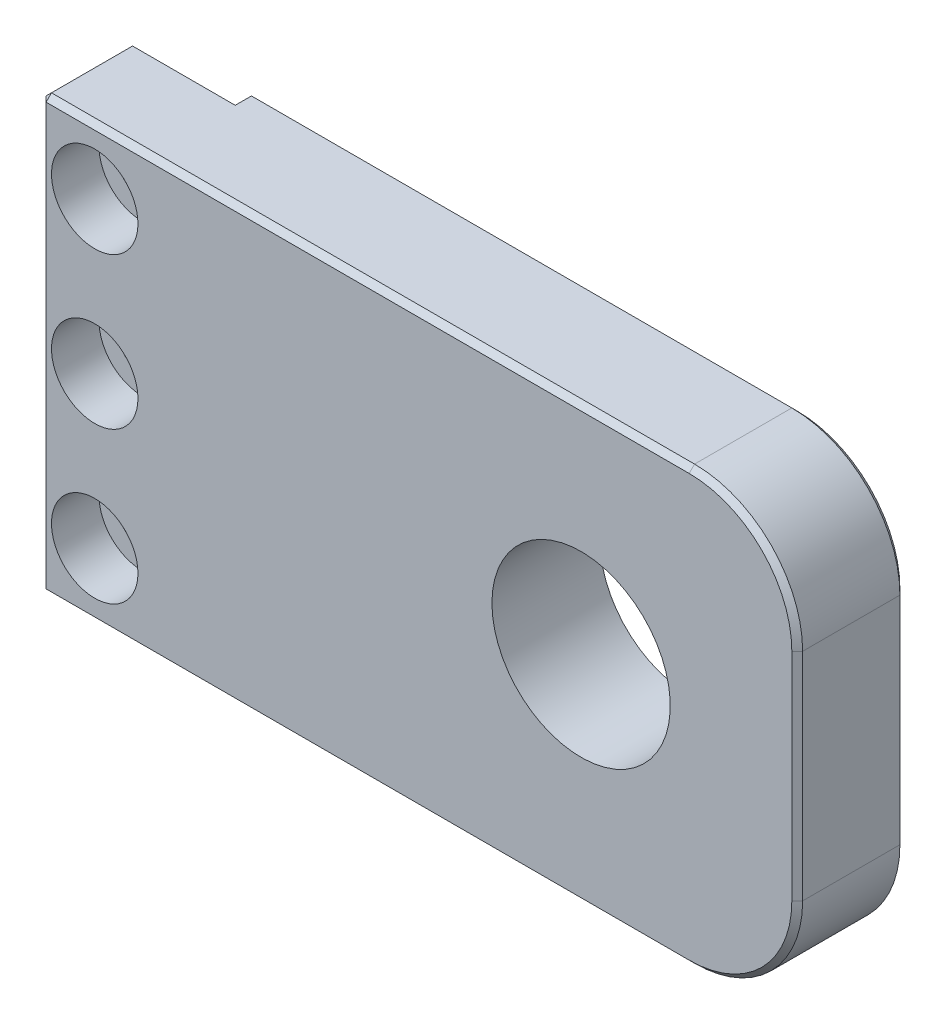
ISO-10303-21;
HEADER;
FILE_DESCRIPTION(('STEP AP214'),'2;1');
FILE_NAME('part.step','',(''),(''),'','','');
FILE_SCHEMA(('AUTOMOTIVE_DESIGN { 1 0 10303 214 1 1 1 1 }'));
ENDSEC;
DATA;
#1=APPLICATION_CONTEXT('core data for automotive mechanical design processes');
#2=APPLICATION_PROTOCOL_DEFINITION('international standard','automotive_design',2000,#1);
#3=PRODUCT_CONTEXT('',#1,'mechanical');
#4=PRODUCT('Part','Part','',(#3));
#5=PRODUCT_RELATED_PRODUCT_CATEGORY('part','',(#4));
#6=PRODUCT_DEFINITION_FORMATION('','',#4);
#7=PRODUCT_DEFINITION_CONTEXT('part definition',#1,'design');
#8=PRODUCT_DEFINITION('design','',#6,#7);
#9=PRODUCT_DEFINITION_SHAPE('','',#8);
#10=(LENGTH_UNIT() NAMED_UNIT(*) SI_UNIT(.MILLI.,.METRE.));
#11=(NAMED_UNIT(*) PLANE_ANGLE_UNIT() SI_UNIT($,.RADIAN.));
#12=(NAMED_UNIT(*) SI_UNIT($,.STERADIAN.) SOLID_ANGLE_UNIT());
#13=UNCERTAINTY_MEASURE_WITH_UNIT(LENGTH_MEASURE(1.E-05),#10,'distance_accuracy_value','');
#14=(GEOMETRIC_REPRESENTATION_CONTEXT(3) GLOBAL_UNCERTAINTY_ASSIGNED_CONTEXT((#13)) GLOBAL_UNIT_ASSIGNED_CONTEXT((#10,
#11,#12)) REPRESENTATION_CONTEXT('',''));
#15=CARTESIAN_POINT('',(0.,0.,0.));
#16=DIRECTION('',(0.,0.,1.));
#17=DIRECTION('',(1.,0.,0.));
#18=AXIS2_PLACEMENT_3D('',#15,#16,#17);
#19=CARTESIAN_POINT('',(35.,20.,10.));
#20=DIRECTION('',(-1.,0.,0.));
#21=DIRECTION('',(0.,0.,1.));
#22=AXIS2_PLACEMENT_3D('',#19,#20,#21);
#23=PLANE('',#22);
#24=DIRECTION('',(0.,0.,-1.));
#25=VECTOR('',#24,1.);
#26=CARTESIAN_POINT('',(35.,-10.,10.));
#27=LINE('',#26,#25);
#28=CARTESIAN_POINT('',(35.,-10.,9.5));
#29=VERTEX_POINT('',#28);
#30=CARTESIAN_POINT('',(35.,-10.,0.500000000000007));
#31=VERTEX_POINT('',#30);
#32=EDGE_CURVE('E176',#29,#31,#27,.T.);
#33=ORIENTED_EDGE('',*,*,#32,.T.);
#34=DIRECTION('',(0.,1.,0.));
#35=VECTOR('',#34,1.);
#36=CARTESIAN_POINT('',(35.,20.,0.500000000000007));
#37=LINE('',#36,#35);
#38=CARTESIAN_POINT('',(35.,10.,0.500000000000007));
#39=VERTEX_POINT('',#38);
#40=EDGE_CURVE('E249',#31,#39,#37,.T.);
#41=ORIENTED_EDGE('',*,*,#40,.T.);
#42=DIRECTION('',(0.,0.,-1.));
#43=VECTOR('',#42,1.);
#44=CARTESIAN_POINT('',(35.,10.,10.));
#45=LINE('',#44,#43);
#46=CARTESIAN_POINT('',(35.,10.,9.5));
#47=VERTEX_POINT('',#46);
#48=EDGE_CURVE('E178',#39,#47,#45,.F.);
#49=ORIENTED_EDGE('',*,*,#48,.T.);
#50=DIRECTION('',(0.,-1.,0.));
#51=VECTOR('',#50,1.);
#52=CARTESIAN_POINT('',(35.,-10.,9.5));
#53=LINE('',#52,#51);
#54=EDGE_CURVE('E38',#47,#29,#53,.T.);
#55=ORIENTED_EDGE('',*,*,#54,.T.);
#56=EDGE_LOOP('',(#33,#41,#49,#55));
#57=FACE_BOUND('',#56,.T.);
#58=ADVANCED_FACE('F16',(#57),#23,.F.);
#59=CARTESIAN_POINT('',(-35.,20.,10.));
#60=DIRECTION('',(0.,-1.,0.));
#61=DIRECTION('',(0.,0.,-1.));
#62=AXIS2_PLACEMENT_3D('',#59,#60,#61);
#63=PLANE('',#62);
#64=DIRECTION('',(0.,0.,-1.));
#65=VECTOR('',#64,1.);
#66=CARTESIAN_POINT('',(25.,20.,10.));
#67=LINE('',#66,#65);
#68=CARTESIAN_POINT('',(25.,20.,9.5));
#69=VERTEX_POINT('',#68);
#70=CARTESIAN_POINT('',(25.,20.,0.500000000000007));
#71=VERTEX_POINT('',#70);
#72=EDGE_CURVE('E171',#69,#71,#67,.T.);
#73=ORIENTED_EDGE('',*,*,#72,.T.);
#74=DIRECTION('',(-1.,0.,0.));
#75=VECTOR('',#74,1.);
#76=CARTESIAN_POINT('',(-35.,20.,0.500000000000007));
#77=LINE('',#76,#75);
#78=CARTESIAN_POINT('',(-25.,20.,0.500000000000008));
#79=VERTEX_POINT('',#78);
#80=EDGE_CURVE('E228',#71,#79,#77,.T.);
#81=ORIENTED_EDGE('',*,*,#80,.T.);
#82=DIRECTION('',(0.,0.,-1.));
#83=VECTOR('',#82,1.);
#84=CARTESIAN_POINT('',(-25.,20.,2.));
#85=LINE('',#84,#83);
#86=CARTESIAN_POINT('',(-25.,20.,2.));
#87=VERTEX_POINT('',#86);
#88=EDGE_CURVE('E158',#87,#79,#85,.T.);
#89=ORIENTED_EDGE('',*,*,#88,.F.);
#90=DIRECTION('',(1.,0.,0.));
#91=VECTOR('',#90,1.);
#92=CARTESIAN_POINT('',(-25.,20.,2.));
#93=LINE('',#92,#91);
#94=CARTESIAN_POINT('',(-34.5,20.,2.));
#95=VERTEX_POINT('',#94);
#96=EDGE_CURVE('E147',#95,#87,#93,.T.);
#97=ORIENTED_EDGE('',*,*,#96,.F.);
#98=DIRECTION('',(0.,0.,1.));
#99=VECTOR('',#98,1.);
#100=CARTESIAN_POINT('',(-34.5,20.,10.));
#101=LINE('',#100,#99);
#102=CARTESIAN_POINT('',(-34.5,20.,9.5));
#103=VERTEX_POINT('',#102);
#104=EDGE_CURVE('E226',#95,#103,#101,.T.);
#105=ORIENTED_EDGE('',*,*,#104,.T.);
#106=DIRECTION('',(1.,0.,0.));
#107=VECTOR('',#106,1.);
#108=CARTESIAN_POINT('',(25.,20.,9.5));
#109=LINE('',#108,#107);
#110=EDGE_CURVE('E224',#103,#69,#109,.T.);
#111=ORIENTED_EDGE('',*,*,#110,.T.);
#112=EDGE_LOOP('',(#73,#81,#89,#97,#105,#111));
#113=FACE_BOUND('',#112,.T.);
#114=ADVANCED_FACE('F311',(#113),#63,.F.);
#115=CARTESIAN_POINT('',(-35.,20.,10.));
#116=DIRECTION('',(1.,0.,0.));
#117=DIRECTION('',(0.,1.,0.));
#118=AXIS2_PLACEMENT_3D('',#115,#116,#117);
#119=PLANE('',#118);
#120=DIRECTION('',(0.,0.,1.));
#121=VECTOR('',#120,1.);
#122=CARTESIAN_POINT('',(-35.,-19.5,10.));
#123=LINE('',#122,#121);
#124=CARTESIAN_POINT('',(-35.,-19.5,2.5));
#125=VERTEX_POINT('',#124);
#126=CARTESIAN_POINT('',(-35.,-19.5,9.5));
#127=VERTEX_POINT('',#126);
#128=EDGE_CURVE('E212',#125,#127,#123,.T.);
#129=ORIENTED_EDGE('',*,*,#128,.T.);
#130=DIRECTION('',(0.,1.,0.));
#131=VECTOR('',#130,1.);
#132=CARTESIAN_POINT('',(-35.,20.,9.5));
#133=LINE('',#132,#131);
#134=CARTESIAN_POINT('',(-35.,19.5,9.5));
#135=VERTEX_POINT('',#134);
#136=EDGE_CURVE('E214',#127,#135,#133,.T.);
#137=ORIENTED_EDGE('',*,*,#136,.T.);
#138=DIRECTION('',(0.,0.,-1.));
#139=VECTOR('',#138,1.);
#140=CARTESIAN_POINT('',(-35.,19.5,10.));
#141=LINE('',#140,#139);
#142=CARTESIAN_POINT('',(-35.,19.5,2.5));
#143=VERTEX_POINT('',#142);
#144=EDGE_CURVE('E208',#135,#143,#141,.T.);
#145=ORIENTED_EDGE('',*,*,#144,.T.);
#146=DIRECTION('',(0.,-1.,0.));
#147=VECTOR('',#146,1.);
#148=CARTESIAN_POINT('',(-35.,20.,2.5));
#149=LINE('',#148,#147);
#150=EDGE_CURVE('E210',#143,#125,#149,.T.);
#151=ORIENTED_EDGE('',*,*,#150,.T.);
#152=EDGE_LOOP('',(#129,#137,#145,#151));
#153=FACE_BOUND('',#152,.T.);
#154=ADVANCED_FACE('F368',(#153),#119,.F.);
#155=CARTESIAN_POINT('',(-35.,-20.,10.));
#156=DIRECTION('',(0.,1.,0.));
#157=DIRECTION('',(0.,0.,1.));
#158=AXIS2_PLACEMENT_3D('',#155,#156,#157);
#159=PLANE('',#158);
#160=DIRECTION('',(0.,0.,-1.));
#161=VECTOR('',#160,1.);
#162=CARTESIAN_POINT('',(-25.,-20.,2.));
#163=LINE('',#162,#161);
#164=CARTESIAN_POINT('',(-25.,-20.,2.));
#165=VERTEX_POINT('',#164);
#166=CARTESIAN_POINT('',(-25.,-20.,0.500000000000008));
#167=VERTEX_POINT('',#166);
#168=EDGE_CURVE('E136',#165,#167,#163,.T.);
#169=ORIENTED_EDGE('',*,*,#168,.T.);
#170=DIRECTION('',(1.,0.,0.));
#171=VECTOR('',#170,1.);
#172=CARTESIAN_POINT('',(-35.,-20.,0.500000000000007));
#173=LINE('',#172,#171);
#174=CARTESIAN_POINT('',(25.,-20.,0.500000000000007));
#175=VERTEX_POINT('',#174);
#176=EDGE_CURVE('E220',#167,#175,#173,.T.);
#177=ORIENTED_EDGE('',*,*,#176,.T.);
#178=DIRECTION('',(0.,0.,-1.));
#179=VECTOR('',#178,1.);
#180=CARTESIAN_POINT('',(25.,-20.,10.));
#181=LINE('',#180,#179);
#182=CARTESIAN_POINT('',(25.,-20.,9.5));
#183=VERTEX_POINT('',#182);
#184=EDGE_CURVE('E180',#175,#183,#181,.F.);
#185=ORIENTED_EDGE('',*,*,#184,.T.);
#186=DIRECTION('',(-1.,0.,0.));
#187=VECTOR('',#186,1.);
#188=CARTESIAN_POINT('',(-35.,-20.,9.5));
#189=LINE('',#188,#187);
#190=CARTESIAN_POINT('',(-34.5,-20.,9.5));
#191=VERTEX_POINT('',#190);
#192=EDGE_CURVE('E217',#183,#191,#189,.T.);
#193=ORIENTED_EDGE('',*,*,#192,.T.);
#194=DIRECTION('',(0.,0.,-1.));
#195=VECTOR('',#194,1.);
#196=CARTESIAN_POINT('',(-34.5,-20.,10.));
#197=LINE('',#196,#195);
#198=CARTESIAN_POINT('',(-34.5,-20.,2.));
#199=VERTEX_POINT('',#198);
#200=EDGE_CURVE('E139',#191,#199,#197,.T.);
#201=ORIENTED_EDGE('',*,*,#200,.T.);
#202=DIRECTION('',(1.,0.,0.));
#203=VECTOR('',#202,1.);
#204=CARTESIAN_POINT('',(-25.,-20.,2.));
#205=LINE('',#204,#203);
#206=EDGE_CURVE('E132',#199,#165,#205,.T.);
#207=ORIENTED_EDGE('',*,*,#206,.T.);
#208=EDGE_LOOP('',(#169,#177,#185,#193,#201,#207));
#209=FACE_BOUND('',#208,.T.);
#210=ADVANCED_FACE('F134',(#209),#159,.F.);
#211=CARTESIAN_POINT('',(0.,0.,10.));
#212=DIRECTION('',(0.,0.,1.));
#213=DIRECTION('',(1.,0.,0.));
#214=AXIS2_PLACEMENT_3D('',#211,#212,#213);
#215=PLANE('',#214);
#216=DIRECTION('',(-1.,0.,0.));
#217=VECTOR('',#216,1.);
#218=CARTESIAN_POINT('',(-35.,19.5,10.));
#219=LINE('',#218,#217);
#220=CARTESIAN_POINT('',(25.,19.5,10.));
#221=VERTEX_POINT('',#220);
#222=CARTESIAN_POINT('',(-34.5,19.5,10.));
#223=VERTEX_POINT('',#222);
#224=EDGE_CURVE('E203',#221,#223,#219,.T.);
#225=ORIENTED_EDGE('',*,*,#224,.T.);
#226=DIRECTION('',(0.,-1.,0.));
#227=VECTOR('',#226,1.);
#228=CARTESIAN_POINT('',(-34.5,-20.,10.));
#229=LINE('',#228,#227);
#230=CARTESIAN_POINT('',(-34.5,-19.5,10.));
#231=VERTEX_POINT('',#230);
#232=EDGE_CURVE('E205',#223,#231,#229,.T.);
#233=ORIENTED_EDGE('',*,*,#232,.T.);
#234=DIRECTION('',(1.,0.,0.));
#235=VECTOR('',#234,1.);
#236=CARTESIAN_POINT('',(25.,-19.5,10.));
#237=LINE('',#236,#235);
#238=CARTESIAN_POINT('',(25.,-19.5,10.));
#239=VERTEX_POINT('',#238);
#240=EDGE_CURVE('E199',#231,#239,#237,.T.);
#241=ORIENTED_EDGE('',*,*,#240,.T.);
#242=CARTESIAN_POINT('',(25.,-10.,10.));
#243=DIRECTION('',(0.,0.,1.));
#244=DIRECTION('',(1.,0.,0.));
#245=AXIS2_PLACEMENT_3D('',#242,#243,#244);
#246=CIRCLE('',#245,9.5);
#247=CARTESIAN_POINT('',(34.5,-10.,10.));
#248=VERTEX_POINT('',#247);
#249=EDGE_CURVE('E183',#239,#248,#246,.T.);
#250=ORIENTED_EDGE('',*,*,#249,.T.);
#251=DIRECTION('',(0.,1.,0.));
#252=VECTOR('',#251,1.);
#253=CARTESIAN_POINT('',(34.5,10.,10.));
#254=LINE('',#253,#252);
#255=CARTESIAN_POINT('',(34.5,10.,10.));
#256=VERTEX_POINT('',#255);
#257=EDGE_CURVE('E197',#248,#256,#254,.T.);
#258=ORIENTED_EDGE('',*,*,#257,.T.);
#259=CARTESIAN_POINT('',(25.,10.,10.));
#260=DIRECTION('',(0.,0.,1.));
#261=DIRECTION('',(1.,0.,0.));
#262=AXIS2_PLACEMENT_3D('',#259,#260,#261);
#263=CIRCLE('',#262,9.5);
#264=EDGE_CURVE('E201',#256,#221,#263,.T.);
#265=ORIENTED_EDGE('',*,*,#264,.T.);
#266=EDGE_LOOP('',(#225,#233,#241,#250,#258,#265));
#267=FACE_BOUND('',#266,.T.);
#268=CARTESIAN_POINT('',(-30.,14.,10.));
#269=DIRECTION('',(0.,0.,1.));
#270=DIRECTION('',(1.,0.,0.));
#271=AXIS2_PLACEMENT_3D('',#268,#269,#270);
#272=CIRCLE('',#271,4.);
#273=CARTESIAN_POINT('',(-26.,14.,10.));
#274=VERTEX_POINT('',#273);
#275=EDGE_CURVE('E285',#274,#274,#272,.T.);
#276=ORIENTED_EDGE('',*,*,#275,.F.);
#277=EDGE_LOOP('',(#276));
#278=FACE_BOUND('',#277,.T.);
#279=CARTESIAN_POINT('',(-30.,0.,10.));
#280=DIRECTION('',(0.,0.,1.));
#281=DIRECTION('',(1.,0.,0.));
#282=AXIS2_PLACEMENT_3D('',#279,#280,#281);
#283=CIRCLE('',#282,4.);
#284=CARTESIAN_POINT('',(-26.,0.,10.));
#285=VERTEX_POINT('',#284);
#286=EDGE_CURVE('E194',#285,#285,#283,.T.);
#287=ORIENTED_EDGE('',*,*,#286,.F.);
#288=EDGE_LOOP('',(#287));
#289=FACE_BOUND('',#288,.T.);
#290=CARTESIAN_POINT('',(-30.,-14.,10.));
#291=DIRECTION('',(0.,0.,1.));
#292=DIRECTION('',(1.,0.,0.));
#293=AXIS2_PLACEMENT_3D('',#290,#291,#292);
#294=CIRCLE('',#293,4.);
#295=CARTESIAN_POINT('',(-26.,-14.,10.));
#296=VERTEX_POINT('',#295);
#297=EDGE_CURVE('E189',#296,#296,#294,.T.);
#298=ORIENTED_EDGE('',*,*,#297,.F.);
#299=EDGE_LOOP('',(#298));
#300=FACE_BOUND('',#299,.T.);
#301=CARTESIAN_POINT('',(14.9999999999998,0.,10.));
#302=DIRECTION('',(0.,0.,-1.));
#303=DIRECTION('',(-1.,0.,0.));
#304=AXIS2_PLACEMENT_3D('',#301,#302,#303);
#305=CIRCLE('',#304,8.25);
#306=CARTESIAN_POINT('',(6.74999999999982,0.,10.));
#307=VERTEX_POINT('',#306);
#308=EDGE_CURVE('E168',#307,#307,#305,.T.);
#309=ORIENTED_EDGE('',*,*,#308,.T.);
#310=EDGE_LOOP('',(#309));
#311=FACE_BOUND('',#310,.T.);
#312=ADVANCED_FACE('F337',(#267,#278,#289,#300,#311),#215,.T.);
#313=CARTESIAN_POINT('',(0.,0.,0.));
#314=DIRECTION('',(0.,0.,1.));
#315=DIRECTION('',(1.,0.,0.));
#316=AXIS2_PLACEMENT_3D('',#313,#314,#315);
#317=PLANE('',#316);
#318=CARTESIAN_POINT('',(14.9999999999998,0.,0.));
#319=DIRECTION('',(0.,0.,-1.));
#320=DIRECTION('',(-1.,0.,0.));
#321=AXIS2_PLACEMENT_3D('',#318,#319,#320);
#322=CIRCLE('',#321,8.25);
#323=CARTESIAN_POINT('',(6.74999999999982,0.,0.));
#324=VERTEX_POINT('',#323);
#325=EDGE_CURVE('E151',#324,#324,#322,.T.);
#326=ORIENTED_EDGE('',*,*,#325,.F.);
#327=EDGE_LOOP('',(#326));
#328=FACE_BOUND('',#327,.T.);
#329=DIRECTION('',(0.,1.,0.));
#330=VECTOR('',#329,1.);
#331=CARTESIAN_POINT('',(-25.,-20.,0.));
#332=LINE('',#331,#330);
#333=CARTESIAN_POINT('',(-25.,-19.5,0.));
#334=VERTEX_POINT('',#333);
#335=CARTESIAN_POINT('',(-25.,19.5,0.));
#336=VERTEX_POINT('',#335);
#337=EDGE_CURVE('E141',#334,#336,#332,.T.);
#338=ORIENTED_EDGE('',*,*,#337,.T.);
#339=DIRECTION('',(1.,0.,0.));
#340=VECTOR('',#339,1.);
#341=CARTESIAN_POINT('',(0.,19.5,0.));
#342=LINE('',#341,#340);
#343=CARTESIAN_POINT('',(25.,19.5,0.));
#344=VERTEX_POINT('',#343);
#345=EDGE_CURVE('E242',#336,#344,#342,.T.);
#346=ORIENTED_EDGE('',*,*,#345,.T.);
#347=CARTESIAN_POINT('',(25.,10.,0.));
#348=DIRECTION('',(0.,0.,1.));
#349=DIRECTION('',(1.,0.,0.));
#350=AXIS2_PLACEMENT_3D('',#347,#348,#349);
#351=CIRCLE('',#350,9.5);
#352=CARTESIAN_POINT('',(34.5,10.,0.));
#353=VERTEX_POINT('',#352);
#354=EDGE_CURVE('E240',#344,#353,#351,.F.);
#355=ORIENTED_EDGE('',*,*,#354,.T.);
#356=DIRECTION('',(0.,-1.,0.));
#357=VECTOR('',#356,1.);
#358=CARTESIAN_POINT('',(34.5,0.,0.));
#359=LINE('',#358,#357);
#360=CARTESIAN_POINT('',(34.5,-10.,0.));
#361=VERTEX_POINT('',#360);
#362=EDGE_CURVE('E238',#353,#361,#359,.T.);
#363=ORIENTED_EDGE('',*,*,#362,.T.);
#364=CARTESIAN_POINT('',(25.,-10.,0.));
#365=DIRECTION('',(0.,0.,1.));
#366=DIRECTION('',(1.,0.,0.));
#367=AXIS2_PLACEMENT_3D('',#364,#365,#366);
#368=CIRCLE('',#367,9.5);
#369=CARTESIAN_POINT('',(25.,-19.5,0.));
#370=VERTEX_POINT('',#369);
#371=EDGE_CURVE('E236',#361,#370,#368,.F.);
#372=ORIENTED_EDGE('',*,*,#371,.T.);
#373=DIRECTION('',(-1.,0.,0.));
#374=VECTOR('',#373,1.);
#375=CARTESIAN_POINT('',(0.,-19.5,0.));
#376=LINE('',#375,#374);
#377=EDGE_CURVE('E234',#370,#334,#376,.T.);
#378=ORIENTED_EDGE('',*,*,#377,.T.);
#379=EDGE_LOOP('',(#338,#346,#355,#363,#372,#378));
#380=FACE_BOUND('',#379,.T.);
#381=ADVANCED_FACE('F305',(#328,#380),#317,.F.);
#382=CARTESIAN_POINT('',(14.9999999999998,0.,10.));
#383=DIRECTION('',(0.,0.,-1.));
#384=DIRECTION('',(-1.,0.,0.));
#385=AXIS2_PLACEMENT_3D('',#382,#383,#384);
#386=CYLINDRICAL_SURFACE('',#385,8.25);
#387=ORIENTED_EDGE('',*,*,#308,.F.);
#388=EDGE_LOOP('',(#387));
#389=FACE_BOUND('',#388,.T.);
#390=ORIENTED_EDGE('',*,*,#325,.T.);
#391=EDGE_LOOP('',(#390));
#392=FACE_BOUND('',#391,.T.);
#393=ADVANCED_FACE('F622',(#389,#392),#386,.F.);
#394=CARTESIAN_POINT('',(-25.,-20.,2.));
#395=DIRECTION('',(1.,0.,0.));
#396=DIRECTION('',(0.,0.,-1.));
#397=AXIS2_PLACEMENT_3D('',#394,#395,#396);
#398=PLANE('',#397);
#399=ORIENTED_EDGE('',*,*,#88,.T.);
#400=DIRECTION('',(0.,0.707106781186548,0.707106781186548));
#401=VECTOR('',#400,1.);
#402=CARTESIAN_POINT('',(-25.,20.,0.500000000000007));
#403=LINE('',#402,#401);
#404=EDGE_CURVE('E232',#79,#336,#403,.F.);
#405=ORIENTED_EDGE('',*,*,#404,.T.);
#406=ORIENTED_EDGE('',*,*,#337,.F.);
#407=DIRECTION('',(0.,0.707106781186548,-0.707106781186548));
#408=VECTOR('',#407,1.);
#409=CARTESIAN_POINT('',(-25.,-20.,0.500000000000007));
#410=LINE('',#409,#408);
#411=EDGE_CURVE('E156',#334,#167,#410,.F.);
#412=ORIENTED_EDGE('',*,*,#411,.T.);
#413=ORIENTED_EDGE('',*,*,#168,.F.);
#414=DIRECTION('',(0.,1.,0.));
#415=VECTOR('',#414,1.);
#416=CARTESIAN_POINT('',(-25.,-20.,2.));
#417=LINE('',#416,#415);
#418=EDGE_CURVE('E144',#165,#87,#417,.T.);
#419=ORIENTED_EDGE('',*,*,#418,.T.);
#420=EDGE_LOOP('',(#399,#405,#406,#412,#413,#419));
#421=FACE_BOUND('',#420,.T.);
#422=ADVANCED_FACE('F153',(#421),#398,.F.);
#423=CARTESIAN_POINT('',(-25.,-20.,2.));
#424=DIRECTION('',(0.,0.,1.));
#425=DIRECTION('',(1.,0.,0.));
#426=AXIS2_PLACEMENT_3D('',#423,#424,#425);
#427=PLANE('',#426);
#428=CARTESIAN_POINT('',(-30.,14.,2.));
#429=DIRECTION('',(0.,0.,1.));
#430=DIRECTION('',(1.,0.,0.));
#431=AXIS2_PLACEMENT_3D('',#428,#429,#430);
#432=CIRCLE('',#431,2.25);
#433=CARTESIAN_POINT('',(-27.75,14.,2.));
#434=VERTEX_POINT('',#433);
#435=EDGE_CURVE('E191',#434,#434,#432,.T.);
#436=ORIENTED_EDGE('',*,*,#435,.T.);
#437=EDGE_LOOP('',(#436));
#438=FACE_BOUND('',#437,.T.);
#439=CARTESIAN_POINT('',(-30.,0.,2.));
#440=DIRECTION('',(0.,0.,1.));
#441=DIRECTION('',(1.,0.,0.));
#442=AXIS2_PLACEMENT_3D('',#439,#440,#441);
#443=CIRCLE('',#442,2.25);
#444=CARTESIAN_POINT('',(-27.75,0.,2.));
#445=VERTEX_POINT('',#444);
#446=EDGE_CURVE('E186',#445,#445,#443,.T.);
#447=ORIENTED_EDGE('',*,*,#446,.T.);
#448=EDGE_LOOP('',(#447));
#449=FACE_BOUND('',#448,.T.);
#450=CARTESIAN_POINT('',(-30.,-14.,2.));
#451=DIRECTION('',(0.,0.,1.));
#452=DIRECTION('',(1.,0.,0.));
#453=AXIS2_PLACEMENT_3D('',#450,#451,#452);
#454=CIRCLE('',#453,2.25);
#455=CARTESIAN_POINT('',(-27.75,-14.,2.));
#456=VERTEX_POINT('',#455);
#457=EDGE_CURVE('E164',#456,#456,#454,.T.);
#458=ORIENTED_EDGE('',*,*,#457,.T.);
#459=EDGE_LOOP('',(#458));
#460=FACE_BOUND('',#459,.T.);
#461=ORIENTED_EDGE('',*,*,#206,.F.);
#462=DIRECTION('',(0.,1.,0.));
#463=VECTOR('',#462,1.);
#464=CARTESIAN_POINT('',(-34.5,-20.,2.));
#465=LINE('',#464,#463);
#466=EDGE_CURVE('E222',#199,#95,#465,.T.);
#467=ORIENTED_EDGE('',*,*,#466,.T.);
#468=ORIENTED_EDGE('',*,*,#96,.T.);
#469=ORIENTED_EDGE('',*,*,#418,.F.);
#470=EDGE_LOOP('',(#461,#467,#468,#469));
#471=FACE_BOUND('',#470,.T.);
#472=ADVANCED_FACE('F145',(#438,#449,#460,#471),#427,.F.);
#473=CARTESIAN_POINT('',(25.,10.,10.));
#474=DIRECTION('',(0.,0.,-1.));
#475=DIRECTION('',(-1.,0.,0.));
#476=AXIS2_PLACEMENT_3D('',#473,#474,#475);
#477=CYLINDRICAL_SURFACE('',#476,10.);
#478=ORIENTED_EDGE('',*,*,#48,.F.);
#479=CARTESIAN_POINT('',(25.,10.,0.500000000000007));
#480=DIRECTION('',(0.,0.,1.));
#481=DIRECTION('',(1.,0.,0.));
#482=AXIS2_PLACEMENT_3D('',#479,#480,#481);
#483=CIRCLE('',#482,10.);
#484=EDGE_CURVE('E246',#39,#71,#483,.T.);
#485=ORIENTED_EDGE('',*,*,#484,.T.);
#486=ORIENTED_EDGE('',*,*,#72,.F.);
#487=CARTESIAN_POINT('',(25.,10.,9.5));
#488=DIRECTION('',(0.,0.,1.));
#489=DIRECTION('',(1.,0.,0.));
#490=AXIS2_PLACEMENT_3D('',#487,#488,#489);
#491=CIRCLE('',#490,10.);
#492=EDGE_CURVE('E244',#69,#47,#491,.F.);
#493=ORIENTED_EDGE('',*,*,#492,.T.);
#494=EDGE_LOOP('',(#478,#485,#486,#493));
#495=FACE_BOUND('',#494,.T.);
#496=ADVANCED_FACE('F324',(#495),#477,.T.);
#497=CARTESIAN_POINT('',(25.,-10.,10.));
#498=DIRECTION('',(0.,0.,-1.));
#499=DIRECTION('',(-1.,0.,0.));
#500=AXIS2_PLACEMENT_3D('',#497,#498,#499);
#501=CYLINDRICAL_SURFACE('',#500,10.);
#502=ORIENTED_EDGE('',*,*,#184,.F.);
#503=CARTESIAN_POINT('',(25.,-10.,0.500000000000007));
#504=DIRECTION('',(0.,0.,1.));
#505=DIRECTION('',(1.,0.,0.));
#506=AXIS2_PLACEMENT_3D('',#503,#504,#505);
#507=CIRCLE('',#506,10.);
#508=EDGE_CURVE('E11',#175,#31,#507,.T.);
#509=ORIENTED_EDGE('',*,*,#508,.T.);
#510=ORIENTED_EDGE('',*,*,#32,.F.);
#511=CARTESIAN_POINT('',(25.,-10.,9.5));
#512=DIRECTION('',(0.,0.,1.));
#513=DIRECTION('',(1.,0.,0.));
#514=AXIS2_PLACEMENT_3D('',#511,#512,#513);
#515=CIRCLE('',#514,10.);
#516=EDGE_CURVE('E25',#29,#183,#515,.F.);
#517=ORIENTED_EDGE('',*,*,#516,.T.);
#518=EDGE_LOOP('',(#502,#509,#510,#517));
#519=FACE_BOUND('',#518,.T.);
#520=ADVANCED_FACE('F350',(#519),#501,.T.);
#521=CARTESIAN_POINT('',(-30.,-14.,10.));
#522=DIRECTION('',(0.,0.,1.));
#523=DIRECTION('',(1.,0.,0.));
#524=AXIS2_PLACEMENT_3D('',#521,#522,#523);
#525=CYLINDRICAL_SURFACE('',#524,2.25);
#526=CARTESIAN_POINT('',(-30.,-14.,5.6));
#527=DIRECTION('',(0.,0.,1.));
#528=DIRECTION('',(1.,0.,0.));
#529=AXIS2_PLACEMENT_3D('',#526,#527,#528);
#530=CIRCLE('',#529,2.25);
#531=CARTESIAN_POINT('',(-27.75,-14.,5.6));
#532=VERTEX_POINT('',#531);
#533=EDGE_CURVE('E161',#532,#532,#530,.T.);
#534=ORIENTED_EDGE('',*,*,#533,.T.);
#535=EDGE_LOOP('',(#534));
#536=FACE_BOUND('',#535,.T.);
#537=ORIENTED_EDGE('',*,*,#457,.F.);
#538=EDGE_LOOP('',(#537));
#539=FACE_BOUND('',#538,.T.);
#540=ADVANCED_FACE('F402',(#536,#539),#525,.F.);
#541=CARTESIAN_POINT('',(-27.75,-14.,5.6));
#542=DIRECTION('',(0.,0.,-1.));
#543=DIRECTION('',(-1.,0.,0.));
#544=AXIS2_PLACEMENT_3D('',#541,#542,#543);
#545=PLANE('',#544);
#546=ORIENTED_EDGE('',*,*,#533,.F.);
#547=EDGE_LOOP('',(#546));
#548=FACE_BOUND('',#547,.T.);
#549=CARTESIAN_POINT('',(-30.,-14.,5.6));
#550=DIRECTION('',(0.,0.,1.));
#551=DIRECTION('',(1.,0.,0.));
#552=AXIS2_PLACEMENT_3D('',#549,#550,#551);
#553=CIRCLE('',#552,4.);
#554=CARTESIAN_POINT('',(-26.,-14.,5.6));
#555=VERTEX_POINT('',#554);
#556=EDGE_CURVE('E779',#555,#555,#553,.T.);
#557=ORIENTED_EDGE('',*,*,#556,.T.);
#558=EDGE_LOOP('',(#557));
#559=FACE_BOUND('',#558,.T.);
#560=ADVANCED_FACE('F591',(#548,#559),#545,.F.);
#561=CARTESIAN_POINT('',(-30.,-14.,10.));
#562=DIRECTION('',(0.,0.,1.));
#563=DIRECTION('',(1.,0.,0.));
#564=AXIS2_PLACEMENT_3D('',#561,#562,#563);
#565=CYLINDRICAL_SURFACE('',#564,4.);
#566=ORIENTED_EDGE('',*,*,#556,.F.);
#567=EDGE_LOOP('',(#566));
#568=FACE_BOUND('',#567,.T.);
#569=ORIENTED_EDGE('',*,*,#297,.T.);
#570=EDGE_LOOP('',(#569));
#571=FACE_BOUND('',#570,.T.);
#572=ADVANCED_FACE('F583',(#568,#571),#565,.F.);
#573=CARTESIAN_POINT('',(-30.,0.,10.));
#574=DIRECTION('',(0.,0.,1.));
#575=DIRECTION('',(1.,0.,0.));
#576=AXIS2_PLACEMENT_3D('',#573,#574,#575);
#577=CYLINDRICAL_SURFACE('',#576,2.25);
#578=CARTESIAN_POINT('',(-30.,0.,5.6));
#579=DIRECTION('',(0.,0.,1.));
#580=DIRECTION('',(1.,0.,0.));
#581=AXIS2_PLACEMENT_3D('',#578,#579,#580);
#582=CIRCLE('',#581,2.25);
#583=CARTESIAN_POINT('',(-27.75,0.,5.6));
#584=VERTEX_POINT('',#583);
#585=EDGE_CURVE('E190',#584,#584,#582,.T.);
#586=ORIENTED_EDGE('',*,*,#585,.T.);
#587=EDGE_LOOP('',(#586));
#588=FACE_BOUND('',#587,.T.);
#589=ORIENTED_EDGE('',*,*,#446,.F.);
#590=EDGE_LOOP('',(#589));
#591=FACE_BOUND('',#590,.T.);
#592=ADVANCED_FACE('F575',(#588,#591),#577,.F.);
#593=CARTESIAN_POINT('',(-27.75,0.,5.6));
#594=DIRECTION('',(0.,0.,-1.));
#595=DIRECTION('',(-1.,0.,0.));
#596=AXIS2_PLACEMENT_3D('',#593,#594,#595);
#597=PLANE('',#596);
#598=ORIENTED_EDGE('',*,*,#585,.F.);
#599=EDGE_LOOP('',(#598));
#600=FACE_BOUND('',#599,.T.);
#601=CARTESIAN_POINT('',(-30.,0.,5.6));
#602=DIRECTION('',(0.,0.,1.));
#603=DIRECTION('',(1.,0.,0.));
#604=AXIS2_PLACEMENT_3D('',#601,#602,#603);
#605=CIRCLE('',#604,4.);
#606=CARTESIAN_POINT('',(-26.,0.,5.6));
#607=VERTEX_POINT('',#606);
#608=EDGE_CURVE('E788',#607,#607,#605,.T.);
#609=ORIENTED_EDGE('',*,*,#608,.T.);
#610=EDGE_LOOP('',(#609));
#611=FACE_BOUND('',#610,.T.);
#612=ADVANCED_FACE('F567',(#600,#611),#597,.F.);
#613=CARTESIAN_POINT('',(-30.,0.,10.));
#614=DIRECTION('',(0.,0.,1.));
#615=DIRECTION('',(1.,0.,0.));
#616=AXIS2_PLACEMENT_3D('',#613,#614,#615);
#617=CYLINDRICAL_SURFACE('',#616,4.);
#618=ORIENTED_EDGE('',*,*,#608,.F.);
#619=EDGE_LOOP('',(#618));
#620=FACE_BOUND('',#619,.T.);
#621=ORIENTED_EDGE('',*,*,#286,.T.);
#622=EDGE_LOOP('',(#621));
#623=FACE_BOUND('',#622,.T.);
#624=ADVANCED_FACE('F559',(#620,#623),#617,.F.);
#625=CARTESIAN_POINT('',(-30.,14.,10.));
#626=DIRECTION('',(0.,0.,1.));
#627=DIRECTION('',(1.,0.,0.));
#628=AXIS2_PLACEMENT_3D('',#625,#626,#627);
#629=CYLINDRICAL_SURFACE('',#628,2.25);
#630=CARTESIAN_POINT('',(-30.,14.,5.6));
#631=DIRECTION('',(0.,0.,1.));
#632=DIRECTION('',(1.,0.,0.));
#633=AXIS2_PLACEMENT_3D('',#630,#631,#632);
#634=CIRCLE('',#633,2.25);
#635=CARTESIAN_POINT('',(-27.75,14.,5.6));
#636=VERTEX_POINT('',#635);
#637=EDGE_CURVE('E195',#636,#636,#634,.T.);
#638=ORIENTED_EDGE('',*,*,#637,.T.);
#639=EDGE_LOOP('',(#638));
#640=FACE_BOUND('',#639,.T.);
#641=ORIENTED_EDGE('',*,*,#435,.F.);
#642=EDGE_LOOP('',(#641));
#643=FACE_BOUND('',#642,.T.);
#644=ADVANCED_FACE('F551',(#640,#643),#629,.F.);
#645=CARTESIAN_POINT('',(-27.75,14.,5.6));
#646=DIRECTION('',(0.,0.,-1.));
#647=DIRECTION('',(-1.,0.,0.));
#648=AXIS2_PLACEMENT_3D('',#645,#646,#647);
#649=PLANE('',#648);
#650=ORIENTED_EDGE('',*,*,#637,.F.);
#651=EDGE_LOOP('',(#650));
#652=FACE_BOUND('',#651,.T.);
#653=CARTESIAN_POINT('',(-30.,14.,5.6));
#654=DIRECTION('',(0.,0.,1.));
#655=DIRECTION('',(1.,0.,0.));
#656=AXIS2_PLACEMENT_3D('',#653,#654,#655);
#657=CIRCLE('',#656,4.);
#658=CARTESIAN_POINT('',(-26.,14.,5.6));
#659=VERTEX_POINT('',#658);
#660=EDGE_CURVE('E795',#659,#659,#657,.T.);
#661=ORIENTED_EDGE('',*,*,#660,.T.);
#662=EDGE_LOOP('',(#661));
#663=FACE_BOUND('',#662,.T.);
#664=ADVANCED_FACE('F543',(#652,#663),#649,.F.);
#665=CARTESIAN_POINT('',(-30.,14.,10.));
#666=DIRECTION('',(0.,0.,1.));
#667=DIRECTION('',(1.,0.,0.));
#668=AXIS2_PLACEMENT_3D('',#665,#666,#667);
#669=CYLINDRICAL_SURFACE('',#668,4.);
#670=ORIENTED_EDGE('',*,*,#660,.F.);
#671=EDGE_LOOP('',(#670));
#672=FACE_BOUND('',#671,.T.);
#673=ORIENTED_EDGE('',*,*,#275,.T.);
#674=EDGE_LOOP('',(#673));
#675=FACE_BOUND('',#674,.T.);
#676=ADVANCED_FACE('F421',(#672,#675),#669,.F.);
#677=CARTESIAN_POINT('',(34.5,0.,10.));
#678=DIRECTION('',(0.707106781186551,0.,0.707106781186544));
#679=DIRECTION('',(0.,-1.,0.));
#680=AXIS2_PLACEMENT_3D('',#677,#678,#679);
#681=PLANE('',#680);
#682=DIRECTION('',(-0.707106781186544,0.,0.707106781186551));
#683=VECTOR('',#682,1.);
#684=CARTESIAN_POINT('',(35.,-10.,9.5));
#685=LINE('',#684,#683);
#686=EDGE_CURVE('E279',#29,#248,#685,.T.);
#687=ORIENTED_EDGE('',*,*,#686,.F.);
#688=ORIENTED_EDGE('',*,*,#54,.F.);
#689=DIRECTION('',(0.707106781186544,0.,-0.707106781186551));
#690=VECTOR('',#689,1.);
#691=CARTESIAN_POINT('',(34.5,10.,10.));
#692=LINE('',#691,#690);
#693=EDGE_CURVE('E282',#256,#47,#692,.T.);
#694=ORIENTED_EDGE('',*,*,#693,.F.);
#695=ORIENTED_EDGE('',*,*,#257,.F.);
#696=EDGE_LOOP('',(#687,#688,#694,#695));
#697=FACE_BOUND('',#696,.T.);
#698=ADVANCED_FACE('F344',(#697),#681,.T.);
#699=CARTESIAN_POINT('',(25.,10.,10.));
#700=DIRECTION('',(0.,0.,-1.));
#701=DIRECTION('',(-1.,0.,0.));
#702=AXIS2_PLACEMENT_3D('',#699,#700,#701);
#703=CONICAL_SURFACE('',#702,9.5,0.785398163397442);
#704=ORIENTED_EDGE('',*,*,#693,.T.);
#705=ORIENTED_EDGE('',*,*,#492,.F.);
#706=DIRECTION('',(0.,0.707106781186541,-0.707106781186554));
#707=VECTOR('',#706,1.);
#708=CARTESIAN_POINT('',(25.,19.5,10.));
#709=LINE('',#708,#707);
#710=EDGE_CURVE('E273',#221,#69,#709,.T.);
#711=ORIENTED_EDGE('',*,*,#710,.F.);
#712=ORIENTED_EDGE('',*,*,#264,.F.);
#713=EDGE_LOOP('',(#704,#705,#711,#712));
#714=FACE_BOUND('',#713,.T.);
#715=ADVANCED_FACE('F327',(#714),#703,.T.);
#716=CARTESIAN_POINT('',(25.,-10.,10.));
#717=DIRECTION('',(0.,0.,-1.));
#718=DIRECTION('',(-1.,0.,0.));
#719=AXIS2_PLACEMENT_3D('',#716,#717,#718);
#720=CONICAL_SURFACE('',#719,9.5,0.785398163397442);
#721=ORIENTED_EDGE('',*,*,#686,.T.);
#722=ORIENTED_EDGE('',*,*,#249,.F.);
#723=DIRECTION('',(0.,0.707106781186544,0.707106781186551));
#724=VECTOR('',#723,1.);
#725=CARTESIAN_POINT('',(25.,-20.,9.5));
#726=LINE('',#725,#724);
#727=EDGE_CURVE('E270',#183,#239,#726,.T.);
#728=ORIENTED_EDGE('',*,*,#727,.F.);
#729=ORIENTED_EDGE('',*,*,#516,.F.);
#730=EDGE_LOOP('',(#721,#722,#728,#729));
#731=FACE_BOUND('',#730,.T.);
#732=ADVANCED_FACE('F348',(#731),#720,.T.);
#733=CARTESIAN_POINT('',(-34.5,-20.,2.));
#734=DIRECTION('',(0.707106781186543,0.,0.707106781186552));
#735=DIRECTION('',(0.,1.,0.));
#736=AXIS2_PLACEMENT_3D('',#733,#734,#735);
#737=PLANE('',#736);
#738=DIRECTION('',(-0.577350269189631,0.577350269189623,0.577350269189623));
#739=VECTOR('',#738,1.);
#740=CARTESIAN_POINT('',(-34.5,-20.,2.));
#741=LINE('',#740,#739);
#742=EDGE_CURVE('E268',#125,#199,#741,.F.);
#743=ORIENTED_EDGE('',*,*,#742,.F.);
#744=ORIENTED_EDGE('',*,*,#150,.F.);
#745=DIRECTION('',(-0.577350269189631,-0.577350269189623,0.577350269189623));
#746=VECTOR('',#745,1.);
#747=CARTESIAN_POINT('',(-37.5,17.,5.));
#748=LINE('',#747,#746);
#749=EDGE_CURVE('E276',#95,#143,#748,.T.);
#750=ORIENTED_EDGE('',*,*,#749,.F.);
#751=ORIENTED_EDGE('',*,*,#466,.F.);
#752=EDGE_LOOP('',(#743,#744,#750,#751));
#753=FACE_BOUND('',#752,.T.);
#754=ADVANCED_FACE('F373',(#753),#737,.F.);
#755=CARTESIAN_POINT('',(-35.,19.5,10.));
#756=DIRECTION('',(0.707106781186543,-0.707106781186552,0.));
#757=DIRECTION('',(0.,0.,-1.));
#758=AXIS2_PLACEMENT_3D('',#755,#756,#757);
#759=PLANE('',#758);
#760=ORIENTED_EDGE('',*,*,#749,.T.);
#761=ORIENTED_EDGE('',*,*,#144,.F.);
#762=DIRECTION('',(0.707106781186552,0.707106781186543,0.));
#763=VECTOR('',#762,1.);
#764=CARTESIAN_POINT('',(-35.,19.5,9.5));
#765=LINE('',#764,#763);
#766=EDGE_CURVE('E265',#103,#135,#765,.F.);
#767=ORIENTED_EDGE('',*,*,#766,.F.);
#768=ORIENTED_EDGE('',*,*,#104,.F.);
#769=EDGE_LOOP('',(#760,#761,#767,#768));
#770=FACE_BOUND('',#769,.T.);
#771=ADVANCED_FACE('F376',(#770),#759,.F.);
#772=CARTESIAN_POINT('',(0.,19.5,10.));
#773=DIRECTION('',(0.,0.707106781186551,0.707106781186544));
#774=DIRECTION('',(1.,0.,0.));
#775=AXIS2_PLACEMENT_3D('',#772,#773,#774);
#776=PLANE('',#775);
#777=ORIENTED_EDGE('',*,*,#710,.T.);
#778=ORIENTED_EDGE('',*,*,#110,.F.);
#779=DIRECTION('',(0.,0.707106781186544,-0.707106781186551));
#780=VECTOR('',#779,1.);
#781=CARTESIAN_POINT('',(-34.5,19.75,9.75));
#782=LINE('',#781,#780);
#783=EDGE_CURVE('E262',#223,#103,#782,.T.);
#784=ORIENTED_EDGE('',*,*,#783,.F.);
#785=ORIENTED_EDGE('',*,*,#224,.F.);
#786=EDGE_LOOP('',(#777,#778,#784,#785));
#787=FACE_BOUND('',#786,.T.);
#788=ADVANCED_FACE('F332',(#787),#776,.T.);
#789=CARTESIAN_POINT('',(0.,-19.5,10.));
#790=DIRECTION('',(0.,-0.707106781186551,0.707106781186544));
#791=DIRECTION('',(-1.,0.,0.));
#792=AXIS2_PLACEMENT_3D('',#789,#790,#791);
#793=PLANE('',#792);
#794=ORIENTED_EDGE('',*,*,#727,.T.);
#795=ORIENTED_EDGE('',*,*,#240,.F.);
#796=DIRECTION('',(0.,0.707106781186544,0.707106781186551));
#797=VECTOR('',#796,1.);
#798=CARTESIAN_POINT('',(-34.5,-19.5,10.));
#799=LINE('',#798,#797);
#800=EDGE_CURVE('E259',#191,#231,#799,.T.);
#801=ORIENTED_EDGE('',*,*,#800,.F.);
#802=ORIENTED_EDGE('',*,*,#192,.F.);
#803=EDGE_LOOP('',(#794,#795,#801,#802));
#804=FACE_BOUND('',#803,.T.);
#805=ADVANCED_FACE('F361',(#804),#793,.T.);
#806=CARTESIAN_POINT('',(-34.5,-20.,10.));
#807=DIRECTION('',(0.707106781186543,0.707106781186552,0.));
#808=DIRECTION('',(0.,0.,-1.));
#809=AXIS2_PLACEMENT_3D('',#806,#807,#808);
#810=PLANE('',#809);
#811=ORIENTED_EDGE('',*,*,#742,.T.);
#812=ORIENTED_EDGE('',*,*,#200,.F.);
#813=DIRECTION('',(-0.707106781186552,0.707106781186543,0.));
#814=VECTOR('',#813,1.);
#815=CARTESIAN_POINT('',(-34.75,-19.75,9.5));
#816=LINE('',#815,#814);
#817=EDGE_CURVE('E256',#127,#191,#816,.F.);
#818=ORIENTED_EDGE('',*,*,#817,.F.);
#819=ORIENTED_EDGE('',*,*,#128,.F.);
#820=EDGE_LOOP('',(#811,#812,#818,#819));
#821=FACE_BOUND('',#820,.T.);
#822=ADVANCED_FACE('F355',(#821),#810,.F.);
#823=CARTESIAN_POINT('',(-35.,19.5,9.5));
#824=DIRECTION('',(-0.577350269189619,0.577350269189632,0.577350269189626));
#825=DIRECTION('',(0.,-0.707106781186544,0.707106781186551));
#826=AXIS2_PLACEMENT_3D('',#823,#824,#825);
#827=PLANE('',#826);
#828=ORIENTED_EDGE('',*,*,#783,.T.);
#829=ORIENTED_EDGE('',*,*,#766,.T.);
#830=DIRECTION('',(0.707106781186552,0.,0.707106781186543));
#831=VECTOR('',#830,1.);
#832=CARTESIAN_POINT('',(-35.,19.5,9.5));
#833=LINE('',#832,#831);
#834=EDGE_CURVE('E254',#223,#135,#833,.F.);
#835=ORIENTED_EDGE('',*,*,#834,.F.);
#836=EDGE_LOOP('',(#828,#829,#835));
#837=FACE_BOUND('',#836,.T.);
#838=ADVANCED_FACE('F378',(#837),#827,.T.);
#839=CARTESIAN_POINT('',(-34.5,-19.5,10.));
#840=DIRECTION('',(-0.577350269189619,-0.577350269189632,0.577350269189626));
#841=DIRECTION('',(0.,-0.707106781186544,-0.707106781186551));
#842=AXIS2_PLACEMENT_3D('',#839,#840,#841);
#843=PLANE('',#842);
#844=ORIENTED_EDGE('',*,*,#817,.T.);
#845=ORIENTED_EDGE('',*,*,#800,.T.);
#846=DIRECTION('',(-0.707106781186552,0.,-0.707106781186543));
#847=VECTOR('',#846,1.);
#848=CARTESIAN_POINT('',(-34.5,-19.5,10.));
#849=LINE('',#848,#847);
#850=EDGE_CURVE('E252',#127,#231,#849,.F.);
#851=ORIENTED_EDGE('',*,*,#850,.F.);
#852=EDGE_LOOP('',(#844,#845,#851));
#853=FACE_BOUND('',#852,.T.);
#854=ADVANCED_FACE('F364',(#853),#843,.T.);
#855=CARTESIAN_POINT('',(-34.5,0.,10.));
#856=DIRECTION('',(-0.707106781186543,0.,0.707106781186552));
#857=DIRECTION('',(0.,1.,0.));
#858=AXIS2_PLACEMENT_3D('',#855,#856,#857);
#859=PLANE('',#858);
#860=ORIENTED_EDGE('',*,*,#834,.T.);
#861=ORIENTED_EDGE('',*,*,#136,.F.);
#862=ORIENTED_EDGE('',*,*,#850,.T.);
#863=ORIENTED_EDGE('',*,*,#232,.F.);
#864=EDGE_LOOP('',(#860,#861,#862,#863));
#865=FACE_BOUND('',#864,.T.);
#866=ADVANCED_FACE('F366',(#865),#859,.T.);
#867=CARTESIAN_POINT('',(-35.,-20.,0.500000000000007));
#868=DIRECTION('',(0.,0.707106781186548,0.707106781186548));
#869=DIRECTION('',(1.,0.,0.));
#870=AXIS2_PLACEMENT_3D('',#867,#868,#869);
#871=PLANE('',#870);
#872=ORIENTED_EDGE('',*,*,#411,.F.);
#873=ORIENTED_EDGE('',*,*,#377,.F.);
#874=DIRECTION('',(0.,0.707106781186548,-0.707106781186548));
#875=VECTOR('',#874,1.);
#876=CARTESIAN_POINT('',(25.,-20.,0.500000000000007));
#877=LINE('',#876,#875);
#878=EDGE_CURVE('E20',#175,#370,#877,.T.);
#879=ORIENTED_EDGE('',*,*,#878,.F.);
#880=ORIENTED_EDGE('',*,*,#176,.F.);
#881=EDGE_LOOP('',(#872,#873,#879,#880));
#882=FACE_BOUND('',#881,.T.);
#883=ADVANCED_FACE('F18',(#882),#871,.F.);
#884=CARTESIAN_POINT('',(25.,-10.,0.));
#885=DIRECTION('',(0.,0.,1.));
#886=DIRECTION('',(1.,0.,0.));
#887=AXIS2_PLACEMENT_3D('',#884,#885,#886);
#888=CONICAL_SURFACE('',#887,9.5,0.785398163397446);
#889=ORIENTED_EDGE('',*,*,#878,.T.);
#890=ORIENTED_EDGE('',*,*,#371,.F.);
#891=DIRECTION('',(-0.707106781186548,0.,-0.707106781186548));
#892=VECTOR('',#891,1.);
#893=CARTESIAN_POINT('',(35.,-10.,0.500000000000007));
#894=LINE('',#893,#892);
#895=EDGE_CURVE('E291',#31,#361,#894,.T.);
#896=ORIENTED_EDGE('',*,*,#895,.F.);
#897=ORIENTED_EDGE('',*,*,#508,.F.);
#898=EDGE_LOOP('',(#889,#890,#896,#897));
#899=FACE_BOUND('',#898,.T.);
#900=ADVANCED_FACE('F301',(#899),#888,.T.);
#901=CARTESIAN_POINT('',(35.,20.,0.500000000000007));
#902=DIRECTION('',(-0.707106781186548,0.,0.707106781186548));
#903=DIRECTION('',(0.,1.,0.));
#904=AXIS2_PLACEMENT_3D('',#901,#902,#903);
#905=PLANE('',#904);
#906=ORIENTED_EDGE('',*,*,#895,.T.);
#907=ORIENTED_EDGE('',*,*,#362,.F.);
#908=DIRECTION('',(-0.707106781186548,0.,-0.707106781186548));
#909=VECTOR('',#908,1.);
#910=CARTESIAN_POINT('',(35.,10.,0.500000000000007));
#911=LINE('',#910,#909);
#912=EDGE_CURVE('E289',#39,#353,#911,.T.);
#913=ORIENTED_EDGE('',*,*,#912,.F.);
#914=ORIENTED_EDGE('',*,*,#40,.F.);
#915=EDGE_LOOP('',(#906,#907,#913,#914));
#916=FACE_BOUND('',#915,.T.);
#917=ADVANCED_FACE('F322',(#916),#905,.F.);
#918=CARTESIAN_POINT('',(25.,10.,0.));
#919=DIRECTION('',(0.,0.,1.));
#920=DIRECTION('',(1.,0.,0.));
#921=AXIS2_PLACEMENT_3D('',#918,#919,#920);
#922=CONICAL_SURFACE('',#921,9.5,0.785398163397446);
#923=ORIENTED_EDGE('',*,*,#912,.T.);
#924=ORIENTED_EDGE('',*,*,#354,.F.);
#925=DIRECTION('',(0.,-0.707106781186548,-0.707106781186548));
#926=VECTOR('',#925,1.);
#927=CARTESIAN_POINT('',(25.,20.,0.500000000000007));
#928=LINE('',#927,#926);
#929=EDGE_CURVE('E286',#71,#344,#928,.T.);
#930=ORIENTED_EDGE('',*,*,#929,.F.);
#931=ORIENTED_EDGE('',*,*,#484,.F.);
#932=EDGE_LOOP('',(#923,#924,#930,#931));
#933=FACE_BOUND('',#932,.T.);
#934=ADVANCED_FACE('F320',(#933),#922,.T.);
#935=CARTESIAN_POINT('',(-35.,20.,0.500000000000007));
#936=DIRECTION('',(0.,-0.707106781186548,0.707106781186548));
#937=DIRECTION('',(-1.,0.,0.));
#938=AXIS2_PLACEMENT_3D('',#935,#936,#937);
#939=PLANE('',#938);
#940=ORIENTED_EDGE('',*,*,#929,.T.);
#941=ORIENTED_EDGE('',*,*,#345,.F.);
#942=ORIENTED_EDGE('',*,*,#404,.F.);
#943=ORIENTED_EDGE('',*,*,#80,.F.);
#944=EDGE_LOOP('',(#940,#941,#942,#943));
#945=FACE_BOUND('',#944,.T.);
#946=ADVANCED_FACE('F309',(#945),#939,.F.);
#947=CLOSED_SHELL('',(#58,#114,#154,#210,#312,#381,#393,#422,#472,#496,#520,#540,#560,#572,#592,
#612,#624,#644,#664,#676,#698,#715,#732,#754,#771,#788,#805,#822,#838,#854,#866,#883,#900,#917,
#934,#946));
#948=MANIFOLD_SOLID_BREP('B1',#947);
#949=ADVANCED_BREP_SHAPE_REPRESENTATION('',(#18,#948),#14);
#950=SHAPE_DEFINITION_REPRESENTATION(#9,#949);
ENDSEC;
END-ISO-10303-21;
